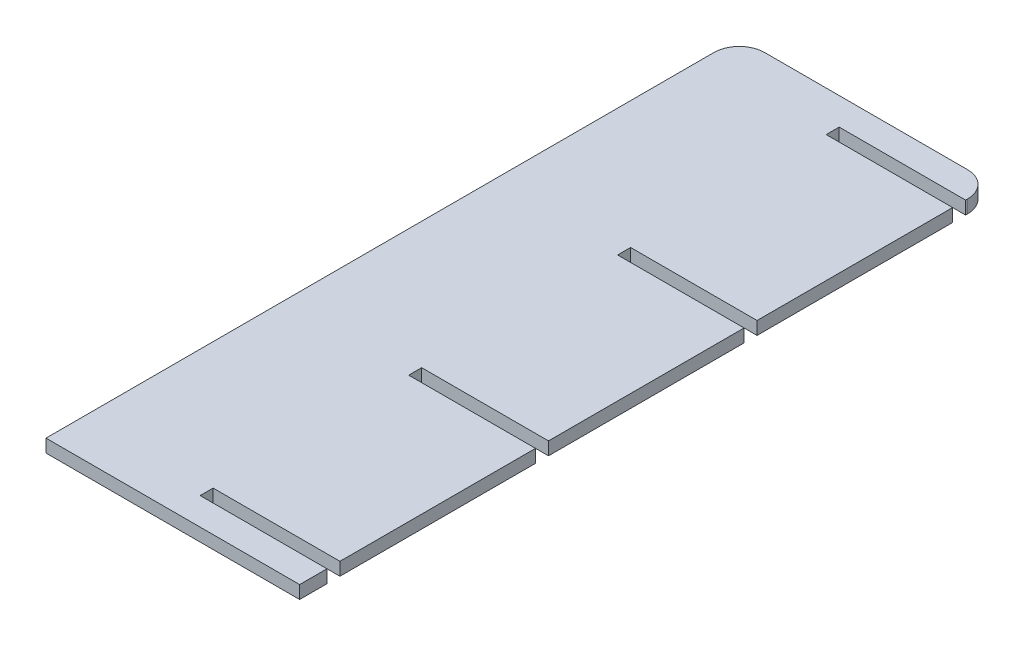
from build123d import *

# Parameters (mm, degrees)
SALIENTE_EXTRUIR1_DEPTH = 23


with BuildPart() as part:
    # Croquis1 → Saliente-Extruir1 (new body)
    with BuildSketch(Plane(origin=(0, 0, 0), x_dir=(1, 0, 0), z_dir=(0, 1, 0))):
        with BuildLine():
            Line((-56.986045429, -430.770626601), (393.013954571, -430.770626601))
            Line((393.013954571, -430.770626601), (393.013954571, -382.270626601))
            Line((393.013954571, -382.270626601), (168.013954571, -382.270626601))
            Line((168.013954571, -382.270626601), (168.013954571, -359.270626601))
            Line((168.013954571, -359.270626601), (393.013954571, -359.270626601))
            Line((393.013954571, -359.270626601), (393.013954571, -12.270626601))
            Line((393.013954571, -12.270626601), (168.013954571, -12.270626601))
            Line((168.013954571, -12.270626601), (168.013954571, 10.729373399))
            Line((168.013954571, 10.729373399), (393.013954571, 10.729373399))
            Line((393.013954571, 10.729373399), (393.013954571, 357.729373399))
            Line((393.013954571, 357.729373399), (168.716438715, 357.729373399))
            Line((168.716438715, 357.729373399), (168.716438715, 380.729373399))
            Line((168.716438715, 380.729373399), (393.013954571, 380.729373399))
            Line((393.013954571, 380.729373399), (393.013954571, 727.729373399))
            Line((393.013954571, 727.729373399), (168.716438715, 727.729373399))
            Line((168.716438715, 727.729373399), (168.716438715, 750.729373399))
            Line((168.716438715, 750.729373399), (393.013954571, 750.729373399))
            Line((393.013954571, 750.729373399), (393.013954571, 754.229373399))
            ThreePointArc((393.013954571, 754.229373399), (379.833759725, 786.049178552), (348.013954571, 799.229373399))
            Line((348.013954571, 799.229373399), (-11.986045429, 799.229373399))
            ThreePointArc((-11.986045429, 799.229373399), (-43.805850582, 786.049178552), (-56.986045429, 754.229373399))
            Line((-56.986045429, 754.229373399), (-56.986045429, -430.770626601))
        make_face()
    extrude(amount=SALIENTE_EXTRUIR1_DEPTH)


solid = part.part
